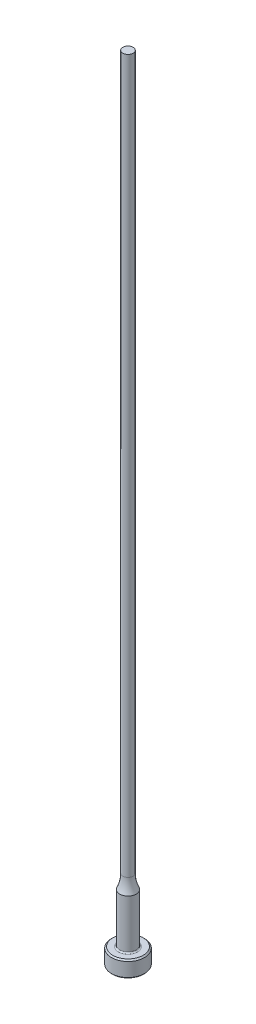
ISO-10303-21;
HEADER;
FILE_DESCRIPTION(('STEP AP214'),'2;1');
FILE_NAME('part.step','',(''),(''),'','','');
FILE_SCHEMA(('AUTOMOTIVE_DESIGN { 1 0 10303 214 1 1 1 1 }'));
ENDSEC;
DATA;
#1=APPLICATION_CONTEXT('core data for automotive mechanical design processes');
#2=APPLICATION_PROTOCOL_DEFINITION('international standard','automotive_design',2000,#1);
#3=PRODUCT_CONTEXT('',#1,'mechanical');
#4=PRODUCT('Part','Part','',(#3));
#5=PRODUCT_RELATED_PRODUCT_CATEGORY('part','',(#4));
#6=PRODUCT_DEFINITION_FORMATION('','',#4);
#7=PRODUCT_DEFINITION_CONTEXT('part definition',#1,'design');
#8=PRODUCT_DEFINITION('design','',#6,#7);
#9=PRODUCT_DEFINITION_SHAPE('','',#8);
#10=(LENGTH_UNIT() NAMED_UNIT(*) SI_UNIT(.MILLI.,.METRE.));
#11=(NAMED_UNIT(*) PLANE_ANGLE_UNIT() SI_UNIT($,.RADIAN.));
#12=(NAMED_UNIT(*) SI_UNIT($,.STERADIAN.) SOLID_ANGLE_UNIT());
#13=UNCERTAINTY_MEASURE_WITH_UNIT(LENGTH_MEASURE(1.E-05),#10,'distance_accuracy_value','');
#14=(GEOMETRIC_REPRESENTATION_CONTEXT(3) GLOBAL_UNCERTAINTY_ASSIGNED_CONTEXT((#13)) GLOBAL_UNIT_ASSIGNED_CONTEXT((#10,
#11,#12)) REPRESENTATION_CONTEXT('',''));
#15=CARTESIAN_POINT('',(0.,0.,0.));
#16=DIRECTION('',(0.,0.,1.));
#17=DIRECTION('',(1.,0.,0.));
#18=AXIS2_PLACEMENT_3D('',#15,#16,#17);
#19=CARTESIAN_POINT('',(-0.991869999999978,152.4,0.));
#20=DIRECTION('',(0.,1.,0.));
#21=DIRECTION('',(0.,0.,1.));
#22=AXIS2_PLACEMENT_3D('',#19,#20,#21);
#23=PLANE('',#22);
#24=CARTESIAN_POINT('',(0.,152.4,0.));
#25=DIRECTION('',(0.,1.,0.));
#26=DIRECTION('',(0.,0.,1.));
#27=AXIS2_PLACEMENT_3D('',#24,#25,#26);
#28=CIRCLE('',#27,0.991869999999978);
#29=CARTESIAN_POINT('',(0.,152.4,0.991869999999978));
#30=VERTEX_POINT('',#29);
#31=EDGE_CURVE('E56',#30,#30,#28,.T.);
#32=ORIENTED_EDGE('',*,*,#31,.T.);
#33=EDGE_LOOP('',(#32));
#34=FACE_BOUND('',#33,.T.);
#35=ADVANCED_FACE('F30',(#34),#23,.T.);
#36=CARTESIAN_POINT('',(0.,259.958771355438,0.));
#37=DIRECTION('',(0.,1.,0.));
#38=DIRECTION('',(0.,0.,1.));
#39=AXIS2_PLACEMENT_3D('',#36,#37,#38);
#40=CYLINDRICAL_SURFACE('',#39,0.991869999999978);
#41=CARTESIAN_POINT('',(0.,15.3850932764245,0.));
#42=DIRECTION('',(0.,1.,0.));
#43=DIRECTION('',(0.,0.,1.));
#44=AXIS2_PLACEMENT_3D('',#41,#42,#43);
#45=CIRCLE('',#44,0.991869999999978);
#46=CARTESIAN_POINT('',(0.,15.3850932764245,0.991869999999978));
#47=VERTEX_POINT('',#46);
#48=EDGE_CURVE('E59',#47,#47,#45,.T.);
#49=ORIENTED_EDGE('',*,*,#48,.T.);
#50=EDGE_LOOP('',(#49));
#51=FACE_BOUND('',#50,.T.);
#52=ORIENTED_EDGE('',*,*,#31,.F.);
#53=EDGE_LOOP('',(#52));
#54=FACE_BOUND('',#53,.T.);
#55=ADVANCED_FACE('F79',(#51,#54),#40,.T.);
#56=CARTESIAN_POINT('',(0.,15.3850932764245,0.));
#57=DIRECTION('',(0.,1.,0.));
#58=DIRECTION('',(0.,0.,1.));
#59=AXIS2_PLACEMENT_3D('',#56,#57,#58);
#60=TOROIDAL_SURFACE('',#59,7.34186999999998,6.35);
#61=CARTESIAN_POINT('',(0.,12.7,0.));
#62=DIRECTION('',(0.,1.,0.));
#63=DIRECTION('',(0.,0.,1.));
#64=AXIS2_PLACEMENT_3D('',#61,#62,#63);
#65=CIRCLE('',#64,1.58749999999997);
#66=CARTESIAN_POINT('',(0.,12.7,1.58749999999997));
#67=VERTEX_POINT('',#66);
#68=EDGE_CURVE('E62',#67,#67,#65,.T.);
#69=ORIENTED_EDGE('',*,*,#68,.T.);
#70=EDGE_LOOP('',(#69));
#71=FACE_BOUND('',#70,.T.);
#72=ORIENTED_EDGE('',*,*,#48,.F.);
#73=EDGE_LOOP('',(#72));
#74=FACE_BOUND('',#73,.T.);
#75=ADVANCED_FACE('F66',(#71,#74),#60,.F.);
#76=CARTESIAN_POINT('',(0.,259.958771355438,0.));
#77=DIRECTION('',(0.,1.,0.));
#78=DIRECTION('',(0.,0.,1.));
#79=AXIS2_PLACEMENT_3D('',#76,#77,#78);
#80=CYLINDRICAL_SURFACE('',#79,1.58749999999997);
#81=CARTESIAN_POINT('',(0.,3.42900000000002,0.));
#82=DIRECTION('',(0.,1.,0.));
#83=DIRECTION('',(0.,0.,1.));
#84=AXIS2_PLACEMENT_3D('',#81,#82,#83);
#85=CIRCLE('',#84,1.58749999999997);
#86=CARTESIAN_POINT('',(0.,3.42900000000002,1.58749999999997));
#87=VERTEX_POINT('',#86);
#88=EDGE_CURVE('E37',#87,#87,#85,.T.);
#89=ORIENTED_EDGE('',*,*,#88,.T.);
#90=EDGE_LOOP('',(#89));
#91=FACE_BOUND('',#90,.T.);
#92=ORIENTED_EDGE('',*,*,#68,.F.);
#93=EDGE_LOOP('',(#92));
#94=FACE_BOUND('',#93,.T.);
#95=ADVANCED_FACE('F69',(#91,#94),#80,.T.);
#96=CARTESIAN_POINT('',(-3.17499999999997,3.175,0.));
#97=DIRECTION('',(0.,1.,0.));
#98=DIRECTION('',(0.,0.,1.));
#99=AXIS2_PLACEMENT_3D('',#96,#97,#98);
#100=PLANE('',#99);
#101=CARTESIAN_POINT('',(0.,3.175,0.));
#102=DIRECTION('',(0.,1.,0.));
#103=DIRECTION('',(0.,0.,1.));
#104=AXIS2_PLACEMENT_3D('',#101,#102,#103);
#105=CIRCLE('',#104,1.84149999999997);
#106=CARTESIAN_POINT('',(0.,3.175,1.84149999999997));
#107=VERTEX_POINT('',#106);
#108=EDGE_CURVE('E10',#107,#107,#105,.F.);
#109=ORIENTED_EDGE('',*,*,#108,.T.);
#110=EDGE_LOOP('',(#109));
#111=FACE_BOUND('',#110,.T.);
#112=CARTESIAN_POINT('',(0.,3.175,0.));
#113=DIRECTION('',(0.,1.,0.));
#114=DIRECTION('',(0.,0.,1.));
#115=AXIS2_PLACEMENT_3D('',#112,#113,#114);
#116=CIRCLE('',#115,2.92099999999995);
#117=CARTESIAN_POINT('',(0.,3.175,2.92099999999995));
#118=VERTEX_POINT('',#117);
#119=EDGE_CURVE('E53',#118,#118,#116,.T.);
#120=ORIENTED_EDGE('',*,*,#119,.T.);
#121=EDGE_LOOP('',(#120));
#122=FACE_BOUND('',#121,.T.);
#123=ADVANCED_FACE('F71',(#111,#122),#100,.T.);
#124=CARTESIAN_POINT('',(0.,259.958771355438,0.));
#125=DIRECTION('',(0.,1.,0.));
#126=DIRECTION('',(0.,0.,1.));
#127=AXIS2_PLACEMENT_3D('',#124,#125,#126);
#128=CYLINDRICAL_SURFACE('',#127,3.17499999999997);
#129=CARTESIAN_POINT('',(0.,2.92100000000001,0.));
#130=DIRECTION('',(0.,1.,0.));
#131=DIRECTION('',(0.,0.,1.));
#132=AXIS2_PLACEMENT_3D('',#129,#130,#131);
#133=CIRCLE('',#132,3.17499999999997);
#134=CARTESIAN_POINT('',(0.,2.92100000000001,3.17499999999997));
#135=VERTEX_POINT('',#134);
#136=EDGE_CURVE('E45',#135,#135,#133,.F.);
#137=ORIENTED_EDGE('',*,*,#136,.T.);
#138=EDGE_LOOP('',(#137));
#139=FACE_BOUND('',#138,.T.);
#140=CARTESIAN_POINT('',(0.,0.254000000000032,0.));
#141=DIRECTION('',(0.,-1.,0.));
#142=DIRECTION('',(0.,0.,-1.));
#143=AXIS2_PLACEMENT_3D('',#140,#141,#142);
#144=CIRCLE('',#143,3.17499999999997);
#145=CARTESIAN_POINT('',(0.,0.254000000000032,-3.17499999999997));
#146=VERTEX_POINT('',#145);
#147=EDGE_CURVE('E50',#146,#146,#144,.F.);
#148=ORIENTED_EDGE('',*,*,#147,.T.);
#149=EDGE_LOOP('',(#148));
#150=FACE_BOUND('',#149,.T.);
#151=ADVANCED_FACE('F77',(#139,#150),#128,.T.);
#152=CARTESIAN_POINT('',(0.,0.,0.));
#153=DIRECTION('',(0.,-1.,0.));
#154=DIRECTION('',(0.,0.,-1.));
#155=AXIS2_PLACEMENT_3D('',#152,#153,#154);
#156=PLANE('',#155);
#157=CARTESIAN_POINT('',(0.,0.,0.));
#158=DIRECTION('',(0.,-1.,0.));
#159=DIRECTION('',(0.,0.,-1.));
#160=AXIS2_PLACEMENT_3D('',#157,#158,#159);
#161=CIRCLE('',#160,2.92099999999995);
#162=CARTESIAN_POINT('',(0.,0.,-2.92099999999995));
#163=VERTEX_POINT('',#162);
#164=EDGE_CURVE('E41',#163,#163,#161,.T.);
#165=ORIENTED_EDGE('',*,*,#164,.T.);
#166=EDGE_LOOP('',(#165));
#167=FACE_BOUND('',#166,.T.);
#168=ADVANCED_FACE('F93',(#167),#156,.T.);
#169=CARTESIAN_POINT('',(0.,3.17499999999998,0.));
#170=DIRECTION('',(0.,-1.,0.));
#171=DIRECTION('',(0.,0.,-1.));
#172=AXIS2_PLACEMENT_3D('',#169,#170,#171);
#173=CONICAL_SURFACE('',#172,2.92099999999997,0.7853981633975);
#174=ORIENTED_EDGE('',*,*,#136,.F.);
#175=EDGE_LOOP('',(#174));
#176=FACE_BOUND('',#175,.T.);
#177=ORIENTED_EDGE('',*,*,#119,.F.);
#178=EDGE_LOOP('',(#177));
#179=FACE_BOUND('',#178,.T.);
#180=ADVANCED_FACE('F90',(#176,#179),#173,.T.);
#181=CARTESIAN_POINT('',(0.,0.254000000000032,0.));
#182=DIRECTION('',(0.,1.,0.));
#183=DIRECTION('',(0.,0.,1.));
#184=AXIS2_PLACEMENT_3D('',#181,#182,#183);
#185=CONICAL_SURFACE('',#184,3.17499999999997,0.785398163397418);
#186=ORIENTED_EDGE('',*,*,#164,.F.);
#187=EDGE_LOOP('',(#186));
#188=FACE_BOUND('',#187,.T.);
#189=ORIENTED_EDGE('',*,*,#147,.F.);
#190=EDGE_LOOP('',(#189));
#191=FACE_BOUND('',#190,.T.);
#192=ADVANCED_FACE('F92',(#188,#191),#185,.T.);
#193=CARTESIAN_POINT('',(0.,3.42900000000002,0.));
#194=DIRECTION('',(0.,1.,0.));
#195=DIRECTION('',(0.,0.,1.));
#196=AXIS2_PLACEMENT_3D('',#193,#194,#195);
#197=TOROIDAL_SURFACE('',#196,1.84149999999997,0.254);
#198=ORIENTED_EDGE('',*,*,#108,.F.);
#199=EDGE_LOOP('',(#198));
#200=FACE_BOUND('',#199,.T.);
#201=ORIENTED_EDGE('',*,*,#88,.F.);
#202=EDGE_LOOP('',(#201));
#203=FACE_BOUND('',#202,.T.);
#204=ADVANCED_FACE('F32',(#200,#203),#197,.F.);
#205=CLOSED_SHELL('',(#35,#55,#75,#95,#123,#151,#168,#180,#192,#204));
#206=MANIFOLD_SOLID_BREP('B2',#205);
#207=ADVANCED_BREP_SHAPE_REPRESENTATION('',(#18,#206),#14);
#208=SHAPE_DEFINITION_REPRESENTATION(#9,#207);
ENDSEC;
END-ISO-10303-21;
